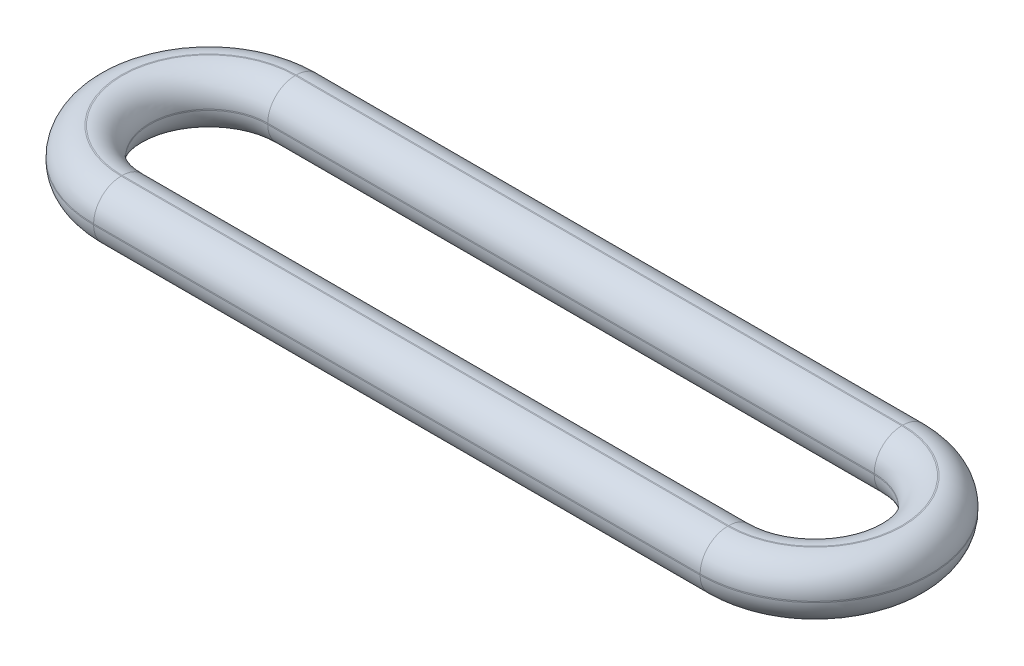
ISO-10303-21;
HEADER;
FILE_DESCRIPTION(('STEP AP214'),'2;1');
FILE_NAME('part.step','',(''),(''),'','','');
FILE_SCHEMA(('AUTOMOTIVE_DESIGN { 1 0 10303 214 1 1 1 1 }'));
ENDSEC;
DATA;
#1=APPLICATION_CONTEXT('core data for automotive mechanical design processes');
#2=APPLICATION_PROTOCOL_DEFINITION('international standard','automotive_design',2000,#1);
#3=PRODUCT_CONTEXT('',#1,'mechanical');
#4=PRODUCT('Part','Part','',(#3));
#5=PRODUCT_RELATED_PRODUCT_CATEGORY('part','',(#4));
#6=PRODUCT_DEFINITION_FORMATION('','',#4);
#7=PRODUCT_DEFINITION_CONTEXT('part definition',#1,'design');
#8=PRODUCT_DEFINITION('design','',#6,#7);
#9=PRODUCT_DEFINITION_SHAPE('','',#8);
#10=(LENGTH_UNIT() NAMED_UNIT(*) SI_UNIT(.MILLI.,.METRE.));
#11=(NAMED_UNIT(*) PLANE_ANGLE_UNIT() SI_UNIT($,.RADIAN.));
#12=(NAMED_UNIT(*) SI_UNIT($,.STERADIAN.) SOLID_ANGLE_UNIT());
#13=UNCERTAINTY_MEASURE_WITH_UNIT(LENGTH_MEASURE(1.E-05),#10,'distance_accuracy_value','');
#14=(GEOMETRIC_REPRESENTATION_CONTEXT(3) GLOBAL_UNCERTAINTY_ASSIGNED_CONTEXT((#13)) GLOBAL_UNIT_ASSIGNED_CONTEXT((#10,
#11,#12)) REPRESENTATION_CONTEXT('',''));
#15=CARTESIAN_POINT('',(0.,0.,0.));
#16=DIRECTION('',(0.,0.,1.));
#17=DIRECTION('',(1.,0.,0.));
#18=AXIS2_PLACEMENT_3D('',#15,#16,#17);
#19=CARTESIAN_POINT('',(0.,1.,0.));
#20=DIRECTION('',(0.,1.,0.));
#21=DIRECTION('',(0.,0.,1.));
#22=AXIS2_PLACEMENT_3D('',#19,#20,#21);
#23=PLANE('',#22);
#24=DIRECTION('',(-1.,0.,0.));
#25=VECTOR('',#24,1.);
#26=CARTESIAN_POINT('',(0.,1.,-1.54));
#27=LINE('',#26,#25);
#28=CARTESIAN_POINT('',(0.,1.,-1.54));
#29=VERTEX_POINT('',#28);
#30=CARTESIAN_POINT('',(10.8,1.,-1.54));
#31=VERTEX_POINT('',#30);
#32=EDGE_CURVE('E52',#29,#31,#27,.F.);
#33=ORIENTED_EDGE('',*,*,#32,.T.);
#34=CARTESIAN_POINT('',(10.8,1.,0.));
#35=DIRECTION('',(0.,1.,0.));
#36=DIRECTION('',(0.,0.,1.));
#37=AXIS2_PLACEMENT_3D('',#34,#35,#36);
#38=CIRCLE('',#37,1.54);
#39=CARTESIAN_POINT('',(10.8,1.,1.54));
#40=VERTEX_POINT('',#39);
#41=EDGE_CURVE('E237',#31,#40,#38,.F.);
#42=ORIENTED_EDGE('',*,*,#41,.T.);
#43=DIRECTION('',(1.,0.,0.));
#44=VECTOR('',#43,1.);
#45=CARTESIAN_POINT('',(0.,1.,1.54));
#46=LINE('',#45,#44);
#47=CARTESIAN_POINT('',(0.,1.,1.54));
#48=VERTEX_POINT('',#47);
#49=EDGE_CURVE('E233',#40,#48,#46,.F.);
#50=ORIENTED_EDGE('',*,*,#49,.T.);
#51=CARTESIAN_POINT('',(0.,1.,0.));
#52=DIRECTION('',(0.,1.,0.));
#53=DIRECTION('',(0.,0.,1.));
#54=AXIS2_PLACEMENT_3D('',#51,#52,#53);
#55=CIRCLE('',#54,1.54);
#56=EDGE_CURVE('E57',#48,#29,#55,.F.);
#57=ORIENTED_EDGE('',*,*,#56,.T.);
#58=EDGE_LOOP('',(#33,#42,#50,#57));
#59=FACE_BOUND('',#58,.T.);
#60=CARTESIAN_POINT('',(10.8,1.,0.));
#61=DIRECTION('',(0.,1.,0.));
#62=DIRECTION('',(0.,0.,1.));
#63=AXIS2_PLACEMENT_3D('',#60,#61,#62);
#64=CIRCLE('',#63,1.56);
#65=CARTESIAN_POINT('',(10.8,1.,1.56));
#66=VERTEX_POINT('',#65);
#67=CARTESIAN_POINT('',(10.8,1.,-1.56));
#68=VERTEX_POINT('',#67);
#69=EDGE_CURVE('E228',#66,#68,#64,.T.);
#70=ORIENTED_EDGE('',*,*,#69,.T.);
#71=DIRECTION('',(-1.,0.,0.));
#72=VECTOR('',#71,1.);
#73=CARTESIAN_POINT('',(0.,1.,-1.56));
#74=LINE('',#73,#72);
#75=CARTESIAN_POINT('',(0.,1.,-1.56));
#76=VERTEX_POINT('',#75);
#77=EDGE_CURVE('E230',#68,#76,#74,.T.);
#78=ORIENTED_EDGE('',*,*,#77,.T.);
#79=CARTESIAN_POINT('',(0.,1.,0.));
#80=DIRECTION('',(0.,1.,0.));
#81=DIRECTION('',(0.,0.,1.));
#82=AXIS2_PLACEMENT_3D('',#79,#80,#81);
#83=CIRCLE('',#82,1.56);
#84=CARTESIAN_POINT('',(0.,1.,1.56));
#85=VERTEX_POINT('',#84);
#86=EDGE_CURVE('E224',#76,#85,#83,.T.);
#87=ORIENTED_EDGE('',*,*,#86,.T.);
#88=DIRECTION('',(1.,0.,0.));
#89=VECTOR('',#88,1.);
#90=CARTESIAN_POINT('',(10.8,1.,1.56));
#91=LINE('',#90,#89);
#92=EDGE_CURVE('E226',#85,#66,#91,.T.);
#93=ORIENTED_EDGE('',*,*,#92,.T.);
#94=EDGE_LOOP('',(#70,#78,#87,#93));
#95=FACE_BOUND('',#94,.T.);
#96=ADVANCED_FACE('F35',(#59,#95),#23,.T.);
#97=CARTESIAN_POINT('',(0.,0.,0.));
#98=DIRECTION('',(0.,1.,0.));
#99=DIRECTION('',(0.,0.,1.));
#100=AXIS2_PLACEMENT_3D('',#97,#98,#99);
#101=PLANE('',#100);
#102=DIRECTION('',(-1.,0.,0.));
#103=VECTOR('',#102,1.);
#104=CARTESIAN_POINT('',(0.,0.,-1.54));
#105=LINE('',#104,#103);
#106=CARTESIAN_POINT('',(10.8,0.,-1.54));
#107=VERTEX_POINT('',#106);
#108=CARTESIAN_POINT('',(0.,0.,-1.54));
#109=VERTEX_POINT('',#108);
#110=EDGE_CURVE('E188',#107,#109,#105,.T.);
#111=ORIENTED_EDGE('',*,*,#110,.T.);
#112=CARTESIAN_POINT('',(0.,0.,0.));
#113=DIRECTION('',(0.,1.,0.));
#114=DIRECTION('',(0.,0.,1.));
#115=AXIS2_PLACEMENT_3D('',#112,#113,#114);
#116=CIRCLE('',#115,1.54);
#117=CARTESIAN_POINT('',(0.,0.,1.54));
#118=VERTEX_POINT('',#117);
#119=EDGE_CURVE('E190',#109,#118,#116,.T.);
#120=ORIENTED_EDGE('',*,*,#119,.T.);
#121=DIRECTION('',(1.,0.,0.));
#122=VECTOR('',#121,1.);
#123=CARTESIAN_POINT('',(10.8,0.,1.54));
#124=LINE('',#123,#122);
#125=CARTESIAN_POINT('',(10.8,0.,1.54));
#126=VERTEX_POINT('',#125);
#127=EDGE_CURVE('E184',#118,#126,#124,.T.);
#128=ORIENTED_EDGE('',*,*,#127,.T.);
#129=CARTESIAN_POINT('',(10.8,0.,0.));
#130=DIRECTION('',(0.,1.,0.));
#131=DIRECTION('',(0.,0.,1.));
#132=AXIS2_PLACEMENT_3D('',#129,#130,#131);
#133=CIRCLE('',#132,1.54);
#134=EDGE_CURVE('E186',#126,#107,#133,.T.);
#135=ORIENTED_EDGE('',*,*,#134,.T.);
#136=EDGE_LOOP('',(#111,#120,#128,#135));
#137=FACE_BOUND('',#136,.T.);
#138=CARTESIAN_POINT('',(10.8,0.,0.));
#139=DIRECTION('',(0.,1.,0.));
#140=DIRECTION('',(0.,0.,1.));
#141=AXIS2_PLACEMENT_3D('',#138,#139,#140);
#142=CIRCLE('',#141,1.56);
#143=CARTESIAN_POINT('',(10.8,0.,-1.56));
#144=VERTEX_POINT('',#143);
#145=CARTESIAN_POINT('',(10.8,0.,1.56));
#146=VERTEX_POINT('',#145);
#147=EDGE_CURVE('E153',#144,#146,#142,.F.);
#148=ORIENTED_EDGE('',*,*,#147,.T.);
#149=DIRECTION('',(1.,0.,0.));
#150=VECTOR('',#149,1.);
#151=CARTESIAN_POINT('',(0.,0.,1.56));
#152=LINE('',#151,#150);
#153=CARTESIAN_POINT('',(0.,0.,1.56));
#154=VERTEX_POINT('',#153);
#155=EDGE_CURVE('E182',#146,#154,#152,.F.);
#156=ORIENTED_EDGE('',*,*,#155,.T.);
#157=CARTESIAN_POINT('',(0.,0.,0.));
#158=DIRECTION('',(0.,1.,0.));
#159=DIRECTION('',(0.,0.,1.));
#160=AXIS2_PLACEMENT_3D('',#157,#158,#159);
#161=CIRCLE('',#160,1.56);
#162=CARTESIAN_POINT('',(0.,0.,-1.56));
#163=VERTEX_POINT('',#162);
#164=EDGE_CURVE('E156',#154,#163,#161,.F.);
#165=ORIENTED_EDGE('',*,*,#164,.T.);
#166=DIRECTION('',(-1.,0.,0.));
#167=VECTOR('',#166,1.);
#168=CARTESIAN_POINT('',(0.,0.,-1.56));
#169=LINE('',#168,#167);
#170=EDGE_CURVE('E148',#163,#144,#169,.F.);
#171=ORIENTED_EDGE('',*,*,#170,.T.);
#172=EDGE_LOOP('',(#148,#156,#165,#171));
#173=FACE_BOUND('',#172,.T.);
#174=ADVANCED_FACE('F150',(#137,#173),#101,.F.);
#175=CARTESIAN_POINT('',(0.,1.,0.));
#176=DIRECTION('',(0.,-1.,0.));
#177=DIRECTION('',(0.,0.,-1.));
#178=AXIS2_PLACEMENT_3D('',#175,#176,#177);
#179=CYLINDRICAL_SURFACE('',#178,2.05);
#180=DIRECTION('',(0.,-1.,0.));
#181=VECTOR('',#180,1.);
#182=CARTESIAN_POINT('',(0.,1.,-2.05));
#183=LINE('',#182,#181);
#184=CARTESIAN_POINT('',(0.,0.51,-2.05));
#185=VERTEX_POINT('',#184);
#186=CARTESIAN_POINT('',(0.,0.49,-2.05));
#187=VERTEX_POINT('',#186);
#188=EDGE_CURVE('E294',#185,#187,#183,.T.);
#189=ORIENTED_EDGE('',*,*,#188,.T.);
#190=CARTESIAN_POINT('',(0.,0.49,0.));
#191=DIRECTION('',(0.,1.,0.));
#192=DIRECTION('',(0.,0.,1.));
#193=AXIS2_PLACEMENT_3D('',#190,#191,#192);
#194=CIRCLE('',#193,2.05);
#195=CARTESIAN_POINT('',(0.,0.49,2.05));
#196=VERTEX_POINT('',#195);
#197=EDGE_CURVE('E214',#187,#196,#194,.T.);
#198=ORIENTED_EDGE('',*,*,#197,.T.);
#199=DIRECTION('',(0.,-1.,0.));
#200=VECTOR('',#199,1.);
#201=CARTESIAN_POINT('',(0.,1.,2.05));
#202=LINE('',#201,#200);
#203=CARTESIAN_POINT('',(0.,0.51,2.05));
#204=VERTEX_POINT('',#203);
#205=EDGE_CURVE('E174',#204,#196,#202,.T.);
#206=ORIENTED_EDGE('',*,*,#205,.F.);
#207=CARTESIAN_POINT('',(0.,0.51,0.));
#208=DIRECTION('',(0.,1.,0.));
#209=DIRECTION('',(0.,0.,1.));
#210=AXIS2_PLACEMENT_3D('',#207,#208,#209);
#211=CIRCLE('',#210,2.05);
#212=EDGE_CURVE('E212',#204,#185,#211,.F.);
#213=ORIENTED_EDGE('',*,*,#212,.T.);
#214=EDGE_LOOP('',(#189,#198,#206,#213));
#215=FACE_BOUND('',#214,.T.);
#216=ADVANCED_FACE('F291',(#215),#179,.T.);
#217=CARTESIAN_POINT('',(10.8,1.,2.05));
#218=DIRECTION('',(0.,0.,-1.));
#219=DIRECTION('',(-1.,0.,0.));
#220=AXIS2_PLACEMENT_3D('',#217,#218,#219);
#221=PLANE('',#220);
#222=ORIENTED_EDGE('',*,*,#205,.T.);
#223=DIRECTION('',(1.,0.,0.));
#224=VECTOR('',#223,1.);
#225=CARTESIAN_POINT('',(10.8,0.49,2.05));
#226=LINE('',#225,#224);
#227=CARTESIAN_POINT('',(10.8,0.49,2.05));
#228=VERTEX_POINT('',#227);
#229=EDGE_CURVE('E209',#196,#228,#226,.T.);
#230=ORIENTED_EDGE('',*,*,#229,.T.);
#231=DIRECTION('',(0.,-1.,0.));
#232=VECTOR('',#231,1.);
#233=CARTESIAN_POINT('',(10.8,1.,2.05));
#234=LINE('',#233,#232);
#235=CARTESIAN_POINT('',(10.8,0.51,2.05));
#236=VERTEX_POINT('',#235);
#237=EDGE_CURVE('E177',#236,#228,#234,.T.);
#238=ORIENTED_EDGE('',*,*,#237,.F.);
#239=DIRECTION('',(1.,0.,0.));
#240=VECTOR('',#239,1.);
#241=CARTESIAN_POINT('',(0.,0.51,2.05));
#242=LINE('',#241,#240);
#243=EDGE_CURVE('E207',#236,#204,#242,.F.);
#244=ORIENTED_EDGE('',*,*,#243,.T.);
#245=EDGE_LOOP('',(#222,#230,#238,#244));
#246=FACE_BOUND('',#245,.T.);
#247=ADVANCED_FACE('F286',(#246),#221,.F.);
#248=CARTESIAN_POINT('',(10.8,1.,0.));
#249=DIRECTION('',(0.,-1.,0.));
#250=DIRECTION('',(0.,0.,-1.));
#251=AXIS2_PLACEMENT_3D('',#248,#249,#250);
#252=CYLINDRICAL_SURFACE('',#251,2.05);
#253=DIRECTION('',(0.,-1.,0.));
#254=VECTOR('',#253,1.);
#255=CARTESIAN_POINT('',(10.8,1.,-2.05));
#256=LINE('',#255,#254);
#257=CARTESIAN_POINT('',(10.8,0.51,-2.05));
#258=VERTEX_POINT('',#257);
#259=CARTESIAN_POINT('',(10.8,0.49,-2.05));
#260=VERTEX_POINT('',#259);
#261=EDGE_CURVE('E304',#258,#260,#256,.T.);
#262=ORIENTED_EDGE('',*,*,#261,.F.);
#263=CARTESIAN_POINT('',(10.8,0.51,0.));
#264=DIRECTION('',(0.,1.,0.));
#265=DIRECTION('',(0.,0.,1.));
#266=AXIS2_PLACEMENT_3D('',#263,#264,#265);
#267=CIRCLE('',#266,2.05);
#268=EDGE_CURVE('E11',#258,#236,#267,.F.);
#269=ORIENTED_EDGE('',*,*,#268,.T.);
#270=ORIENTED_EDGE('',*,*,#237,.T.);
#271=CARTESIAN_POINT('',(10.8,0.49,0.));
#272=DIRECTION('',(0.,1.,0.));
#273=DIRECTION('',(0.,0.,1.));
#274=AXIS2_PLACEMENT_3D('',#271,#272,#273);
#275=CIRCLE('',#274,2.05);
#276=EDGE_CURVE('E44',#228,#260,#275,.T.);
#277=ORIENTED_EDGE('',*,*,#276,.T.);
#278=EDGE_LOOP('',(#262,#269,#270,#277));
#279=FACE_BOUND('',#278,.T.);
#280=ADVANCED_FACE('F302',(#279),#252,.T.);
#281=CARTESIAN_POINT('',(0.,1.,-2.05));
#282=DIRECTION('',(0.,0.,1.));
#283=DIRECTION('',(1.,0.,0.));
#284=AXIS2_PLACEMENT_3D('',#281,#282,#283);
#285=PLANE('',#284);
#286=ORIENTED_EDGE('',*,*,#261,.T.);
#287=DIRECTION('',(-1.,0.,0.));
#288=VECTOR('',#287,1.);
#289=CARTESIAN_POINT('',(0.,0.49,-2.05));
#290=LINE('',#289,#288);
#291=EDGE_CURVE('E165',#260,#187,#290,.T.);
#292=ORIENTED_EDGE('',*,*,#291,.T.);
#293=ORIENTED_EDGE('',*,*,#188,.F.);
#294=DIRECTION('',(-1.,0.,0.));
#295=VECTOR('',#294,1.);
#296=CARTESIAN_POINT('',(10.8,0.51,-2.05));
#297=LINE('',#296,#295);
#298=EDGE_CURVE('E216',#185,#258,#297,.F.);
#299=ORIENTED_EDGE('',*,*,#298,.T.);
#300=EDGE_LOOP('',(#286,#292,#293,#299));
#301=FACE_BOUND('',#300,.T.);
#302=ADVANCED_FACE('F386',(#301),#285,.F.);
#303=CARTESIAN_POINT('',(0.,1.,0.));
#304=DIRECTION('',(0.,-1.,0.));
#305=DIRECTION('',(0.,0.,-1.));
#306=AXIS2_PLACEMENT_3D('',#303,#304,#305);
#307=CYLINDRICAL_SURFACE('',#306,1.05);
#308=DIRECTION('',(0.,-1.,0.));
#309=VECTOR('',#308,1.);
#310=CARTESIAN_POINT('',(0.,1.,1.05));
#311=LINE('',#310,#309);
#312=CARTESIAN_POINT('',(0.,0.51,1.05));
#313=VERTEX_POINT('',#312);
#314=CARTESIAN_POINT('',(0.,0.49,1.05));
#315=VERTEX_POINT('',#314);
#316=EDGE_CURVE('E308',#313,#315,#311,.T.);
#317=ORIENTED_EDGE('',*,*,#316,.T.);
#318=CARTESIAN_POINT('',(0.,0.49,0.));
#319=DIRECTION('',(0.,1.,0.));
#320=DIRECTION('',(0.,0.,1.));
#321=AXIS2_PLACEMENT_3D('',#318,#319,#320);
#322=CIRCLE('',#321,1.05);
#323=CARTESIAN_POINT('',(0.,0.49,-1.05));
#324=VERTEX_POINT('',#323);
#325=EDGE_CURVE('E195',#315,#324,#322,.F.);
#326=ORIENTED_EDGE('',*,*,#325,.T.);
#327=DIRECTION('',(0.,-1.,0.));
#328=VECTOR('',#327,1.);
#329=CARTESIAN_POINT('',(0.,1.,-1.05));
#330=LINE('',#329,#328);
#331=CARTESIAN_POINT('',(0.,0.51,-1.05));
#332=VERTEX_POINT('',#331);
#333=EDGE_CURVE('E250',#332,#324,#330,.T.);
#334=ORIENTED_EDGE('',*,*,#333,.F.);
#335=CARTESIAN_POINT('',(0.,0.51,0.));
#336=DIRECTION('',(0.,1.,0.));
#337=DIRECTION('',(0.,0.,1.));
#338=AXIS2_PLACEMENT_3D('',#335,#336,#337);
#339=CIRCLE('',#338,1.05);
#340=EDGE_CURVE('E193',#332,#313,#339,.T.);
#341=ORIENTED_EDGE('',*,*,#340,.T.);
#342=EDGE_LOOP('',(#317,#326,#334,#341));
#343=FACE_BOUND('',#342,.T.);
#344=ADVANCED_FACE('F326',(#343),#307,.F.);
#345=CARTESIAN_POINT('',(10.8,1.,1.05));
#346=DIRECTION('',(0.,0.,-1.));
#347=DIRECTION('',(-1.,0.,0.));
#348=AXIS2_PLACEMENT_3D('',#345,#346,#347);
#349=PLANE('',#348);
#350=DIRECTION('',(0.,-1.,0.));
#351=VECTOR('',#350,1.);
#352=CARTESIAN_POINT('',(10.8,1.,1.05));
#353=LINE('',#352,#351);
#354=CARTESIAN_POINT('',(10.8,0.51,1.05));
#355=VERTEX_POINT('',#354);
#356=CARTESIAN_POINT('',(10.8,0.49,1.05));
#357=VERTEX_POINT('',#356);
#358=EDGE_CURVE('E311',#355,#357,#353,.T.);
#359=ORIENTED_EDGE('',*,*,#358,.T.);
#360=DIRECTION('',(1.,0.,0.));
#361=VECTOR('',#360,1.);
#362=CARTESIAN_POINT('',(0.,0.49,1.05));
#363=LINE('',#362,#361);
#364=EDGE_CURVE('E222',#357,#315,#363,.F.);
#365=ORIENTED_EDGE('',*,*,#364,.T.);
#366=ORIENTED_EDGE('',*,*,#316,.F.);
#367=DIRECTION('',(1.,0.,0.));
#368=VECTOR('',#367,1.);
#369=CARTESIAN_POINT('',(10.8,0.51,1.05));
#370=LINE('',#369,#368);
#371=EDGE_CURVE('E220',#313,#355,#370,.T.);
#372=ORIENTED_EDGE('',*,*,#371,.T.);
#373=EDGE_LOOP('',(#359,#365,#366,#372));
#374=FACE_BOUND('',#373,.T.);
#375=ADVANCED_FACE('F346',(#374),#349,.T.);
#376=CARTESIAN_POINT('',(10.8,1.,0.));
#377=DIRECTION('',(0.,-1.,0.));
#378=DIRECTION('',(0.,0.,-1.));
#379=AXIS2_PLACEMENT_3D('',#376,#377,#378);
#380=CYLINDRICAL_SURFACE('',#379,1.05);
#381=DIRECTION('',(0.,-1.,0.));
#382=VECTOR('',#381,1.);
#383=CARTESIAN_POINT('',(10.8,1.,-1.05));
#384=LINE('',#383,#382);
#385=CARTESIAN_POINT('',(10.8,0.51,-1.05));
#386=VERTEX_POINT('',#385);
#387=CARTESIAN_POINT('',(10.8,0.49,-1.05));
#388=VERTEX_POINT('',#387);
#389=EDGE_CURVE('E314',#386,#388,#384,.T.);
#390=ORIENTED_EDGE('',*,*,#389,.T.);
#391=CARTESIAN_POINT('',(10.8,0.49,0.));
#392=DIRECTION('',(0.,1.,0.));
#393=DIRECTION('',(0.,0.,1.));
#394=AXIS2_PLACEMENT_3D('',#391,#392,#393);
#395=CIRCLE('',#394,1.05);
#396=EDGE_CURVE('E205',#388,#357,#395,.F.);
#397=ORIENTED_EDGE('',*,*,#396,.T.);
#398=ORIENTED_EDGE('',*,*,#358,.F.);
#399=CARTESIAN_POINT('',(10.8,0.51,0.));
#400=DIRECTION('',(0.,1.,0.));
#401=DIRECTION('',(0.,0.,1.));
#402=AXIS2_PLACEMENT_3D('',#399,#400,#401);
#403=CIRCLE('',#402,1.05);
#404=EDGE_CURVE('E202',#355,#386,#403,.T.);
#405=ORIENTED_EDGE('',*,*,#404,.T.);
#406=EDGE_LOOP('',(#390,#397,#398,#405));
#407=FACE_BOUND('',#406,.T.);
#408=ADVANCED_FACE('F349',(#407),#380,.F.);
#409=CARTESIAN_POINT('',(0.,1.,-1.05));
#410=DIRECTION('',(0.,0.,1.));
#411=DIRECTION('',(1.,0.,0.));
#412=AXIS2_PLACEMENT_3D('',#409,#410,#411);
#413=PLANE('',#412);
#414=ORIENTED_EDGE('',*,*,#333,.T.);
#415=DIRECTION('',(-1.,0.,0.));
#416=VECTOR('',#415,1.);
#417=CARTESIAN_POINT('',(10.8,0.49,-1.05));
#418=LINE('',#417,#416);
#419=EDGE_CURVE('E200',#324,#388,#418,.F.);
#420=ORIENTED_EDGE('',*,*,#419,.T.);
#421=ORIENTED_EDGE('',*,*,#389,.F.);
#422=DIRECTION('',(-1.,0.,0.));
#423=VECTOR('',#422,1.);
#424=CARTESIAN_POINT('',(0.,0.51,-1.05));
#425=LINE('',#424,#423);
#426=EDGE_CURVE('E198',#386,#332,#425,.T.);
#427=ORIENTED_EDGE('',*,*,#426,.T.);
#428=EDGE_LOOP('',(#414,#420,#421,#427));
#429=FACE_BOUND('',#428,.T.);
#430=ADVANCED_FACE('F320',(#429),#413,.T.);
#431=CARTESIAN_POINT('',(10.8,0.49,0.));
#432=DIRECTION('',(0.,1.,0.));
#433=DIRECTION('',(0.,0.,1.));
#434=AXIS2_PLACEMENT_3D('',#431,#432,#433);
#435=TOROIDAL_SURFACE('',#434,1.54,0.49);
#436=CARTESIAN_POINT('',(10.8,0.49,1.54));
#437=DIRECTION('',(-1.,0.,0.));
#438=DIRECTION('',(0.,0.,1.));
#439=AXIS2_PLACEMENT_3D('',#436,#437,#438);
#440=CIRCLE('',#439,0.49);
#441=EDGE_CURVE('E244',#357,#126,#440,.T.);
#442=ORIENTED_EDGE('',*,*,#441,.F.);
#443=ORIENTED_EDGE('',*,*,#396,.F.);
#444=CARTESIAN_POINT('',(10.8,0.49,-1.54));
#445=DIRECTION('',(-1.,0.,0.));
#446=DIRECTION('',(0.,0.,1.));
#447=AXIS2_PLACEMENT_3D('',#444,#445,#446);
#448=CIRCLE('',#447,0.49);
#449=EDGE_CURVE('E247',#107,#388,#448,.T.);
#450=ORIENTED_EDGE('',*,*,#449,.F.);
#451=ORIENTED_EDGE('',*,*,#134,.F.);
#452=EDGE_LOOP('',(#442,#443,#450,#451));
#453=FACE_BOUND('',#452,.T.);
#454=ADVANCED_FACE('F353',(#453),#435,.T.);
#455=CARTESIAN_POINT('',(0.,0.49,-1.54));
#456=DIRECTION('',(1.,0.,0.));
#457=DIRECTION('',(0.,0.,-1.));
#458=AXIS2_PLACEMENT_3D('',#455,#456,#457);
#459=CYLINDRICAL_SURFACE('',#458,0.49);
#460=ORIENTED_EDGE('',*,*,#449,.T.);
#461=ORIENTED_EDGE('',*,*,#419,.F.);
#462=CARTESIAN_POINT('',(0.,0.49,-1.54));
#463=DIRECTION('',(-1.,0.,0.));
#464=DIRECTION('',(0.,0.,1.));
#465=AXIS2_PLACEMENT_3D('',#462,#463,#464);
#466=CIRCLE('',#465,0.49);
#467=EDGE_CURVE('E242',#109,#324,#466,.T.);
#468=ORIENTED_EDGE('',*,*,#467,.F.);
#469=ORIENTED_EDGE('',*,*,#110,.F.);
#470=EDGE_LOOP('',(#460,#461,#468,#469));
#471=FACE_BOUND('',#470,.T.);
#472=ADVANCED_FACE('F358',(#471),#459,.T.);
#473=CARTESIAN_POINT('',(0.,0.49,1.54));
#474=DIRECTION('',(-1.,0.,0.));
#475=DIRECTION('',(0.,0.,1.));
#476=AXIS2_PLACEMENT_3D('',#473,#474,#475);
#477=CYLINDRICAL_SURFACE('',#476,0.49);
#478=ORIENTED_EDGE('',*,*,#441,.T.);
#479=ORIENTED_EDGE('',*,*,#127,.F.);
#480=CARTESIAN_POINT('',(0.,0.49,1.54));
#481=DIRECTION('',(-1.,0.,0.));
#482=DIRECTION('',(0.,0.,1.));
#483=AXIS2_PLACEMENT_3D('',#480,#481,#482);
#484=CIRCLE('',#483,0.49);
#485=EDGE_CURVE('E240',#315,#118,#484,.T.);
#486=ORIENTED_EDGE('',*,*,#485,.F.);
#487=ORIENTED_EDGE('',*,*,#364,.F.);
#488=EDGE_LOOP('',(#478,#479,#486,#487));
#489=FACE_BOUND('',#488,.T.);
#490=ADVANCED_FACE('F364',(#489),#477,.T.);
#491=CARTESIAN_POINT('',(0.,0.49,0.));
#492=DIRECTION('',(0.,1.,0.));
#493=DIRECTION('',(0.,0.,1.));
#494=AXIS2_PLACEMENT_3D('',#491,#492,#493);
#495=TOROIDAL_SURFACE('',#494,1.54,0.49);
#496=ORIENTED_EDGE('',*,*,#467,.T.);
#497=ORIENTED_EDGE('',*,*,#325,.F.);
#498=ORIENTED_EDGE('',*,*,#485,.T.);
#499=ORIENTED_EDGE('',*,*,#119,.F.);
#500=EDGE_LOOP('',(#496,#497,#498,#499));
#501=FACE_BOUND('',#500,.T.);
#502=ADVANCED_FACE('F367',(#501),#495,.T.);
#503=CARTESIAN_POINT('',(0.,0.49,-1.56));
#504=DIRECTION('',(-1.,0.,0.));
#505=DIRECTION('',(0.,0.,1.));
#506=AXIS2_PLACEMENT_3D('',#503,#504,#505);
#507=CYLINDRICAL_SURFACE('',#506,0.49);
#508=CARTESIAN_POINT('',(10.8,0.49,-1.56));
#509=DIRECTION('',(1.,0.,0.));
#510=DIRECTION('',(0.,0.,-1.));
#511=AXIS2_PLACEMENT_3D('',#508,#509,#510);
#512=CIRCLE('',#511,0.49);
#513=EDGE_CURVE('E163',#144,#260,#512,.T.);
#514=ORIENTED_EDGE('',*,*,#513,.F.);
#515=ORIENTED_EDGE('',*,*,#170,.F.);
#516=CARTESIAN_POINT('',(0.,0.49,-1.56));
#517=DIRECTION('',(-1.,0.,0.));
#518=DIRECTION('',(0.,0.,1.));
#519=AXIS2_PLACEMENT_3D('',#516,#517,#518);
#520=CIRCLE('',#519,0.49);
#521=EDGE_CURVE('E168',#187,#163,#520,.T.);
#522=ORIENTED_EDGE('',*,*,#521,.F.);
#523=ORIENTED_EDGE('',*,*,#291,.F.);
#524=EDGE_LOOP('',(#514,#515,#522,#523));
#525=FACE_BOUND('',#524,.T.);
#526=ADVANCED_FACE('F164',(#525),#507,.T.);
#527=CARTESIAN_POINT('',(0.,0.49,0.));
#528=DIRECTION('',(0.,1.,0.));
#529=DIRECTION('',(0.,0.,1.));
#530=AXIS2_PLACEMENT_3D('',#527,#528,#529);
#531=TOROIDAL_SURFACE('',#530,1.56,0.49);
#532=ORIENTED_EDGE('',*,*,#521,.T.);
#533=ORIENTED_EDGE('',*,*,#164,.F.);
#534=CARTESIAN_POINT('',(0.,0.49,1.56));
#535=DIRECTION('',(1.,0.,0.));
#536=DIRECTION('',(0.,1.,0.));
#537=AXIS2_PLACEMENT_3D('',#534,#535,#536);
#538=CIRCLE('',#537,0.49);
#539=EDGE_CURVE('E169',#196,#154,#538,.T.);
#540=ORIENTED_EDGE('',*,*,#539,.F.);
#541=ORIENTED_EDGE('',*,*,#197,.F.);
#542=EDGE_LOOP('',(#532,#533,#540,#541));
#543=FACE_BOUND('',#542,.T.);
#544=ADVANCED_FACE('F296',(#543),#531,.T.);
#545=CARTESIAN_POINT('',(10.8,0.49,0.));
#546=DIRECTION('',(0.,1.,0.));
#547=DIRECTION('',(0.,0.,1.));
#548=AXIS2_PLACEMENT_3D('',#545,#546,#547);
#549=TOROIDAL_SURFACE('',#548,1.56,0.49);
#550=ORIENTED_EDGE('',*,*,#513,.T.);
#551=ORIENTED_EDGE('',*,*,#276,.F.);
#552=CARTESIAN_POINT('',(10.8,0.49,1.56));
#553=DIRECTION('',(-1.,0.,0.));
#554=DIRECTION('',(0.,0.,1.));
#555=AXIS2_PLACEMENT_3D('',#552,#553,#554);
#556=CIRCLE('',#555,0.49);
#557=EDGE_CURVE('E173',#146,#228,#556,.T.);
#558=ORIENTED_EDGE('',*,*,#557,.F.);
#559=ORIENTED_EDGE('',*,*,#147,.F.);
#560=EDGE_LOOP('',(#550,#551,#558,#559));
#561=FACE_BOUND('',#560,.T.);
#562=ADVANCED_FACE('F172',(#561),#549,.T.);
#563=CARTESIAN_POINT('',(10.8,0.49,1.56));
#564=DIRECTION('',(1.,0.,0.));
#565=DIRECTION('',(0.,0.,-1.));
#566=AXIS2_PLACEMENT_3D('',#563,#564,#565);
#567=CYLINDRICAL_SURFACE('',#566,0.49);
#568=ORIENTED_EDGE('',*,*,#539,.T.);
#569=ORIENTED_EDGE('',*,*,#155,.F.);
#570=ORIENTED_EDGE('',*,*,#557,.T.);
#571=ORIENTED_EDGE('',*,*,#229,.F.);
#572=EDGE_LOOP('',(#568,#569,#570,#571));
#573=FACE_BOUND('',#572,.T.);
#574=ADVANCED_FACE('F299',(#573),#567,.T.);
#575=CARTESIAN_POINT('',(0.,0.51,0.));
#576=DIRECTION('',(0.,1.,0.));
#577=DIRECTION('',(0.,0.,1.));
#578=AXIS2_PLACEMENT_3D('',#575,#576,#577);
#579=TOROIDAL_SURFACE('',#578,1.54,0.49);
#580=CARTESIAN_POINT('',(0.,0.51,-1.54));
#581=DIRECTION('',(1.,0.,0.));
#582=DIRECTION('',(0.,0.,-1.));
#583=AXIS2_PLACEMENT_3D('',#580,#581,#582);
#584=CIRCLE('',#583,0.49);
#585=EDGE_CURVE('E259',#29,#332,#584,.T.);
#586=ORIENTED_EDGE('',*,*,#585,.F.);
#587=ORIENTED_EDGE('',*,*,#56,.F.);
#588=CARTESIAN_POINT('',(0.,0.51,1.54));
#589=DIRECTION('',(1.,0.,0.));
#590=DIRECTION('',(0.,0.,-1.));
#591=AXIS2_PLACEMENT_3D('',#588,#589,#590);
#592=CIRCLE('',#591,0.49);
#593=EDGE_CURVE('E252',#313,#48,#592,.T.);
#594=ORIENTED_EDGE('',*,*,#593,.F.);
#595=ORIENTED_EDGE('',*,*,#340,.F.);
#596=EDGE_LOOP('',(#586,#587,#594,#595));
#597=FACE_BOUND('',#596,.T.);
#598=ADVANCED_FACE('F331',(#597),#579,.T.);
#599=CARTESIAN_POINT('',(10.8,0.51,1.54));
#600=DIRECTION('',(1.,0.,0.));
#601=DIRECTION('',(0.,0.,-1.));
#602=AXIS2_PLACEMENT_3D('',#599,#600,#601);
#603=CYLINDRICAL_SURFACE('',#602,0.49);
#604=ORIENTED_EDGE('',*,*,#593,.T.);
#605=ORIENTED_EDGE('',*,*,#49,.F.);
#606=CARTESIAN_POINT('',(10.8,0.51,1.54));
#607=DIRECTION('',(1.,0.,0.));
#608=DIRECTION('',(0.,0.,-1.));
#609=AXIS2_PLACEMENT_3D('',#606,#607,#608);
#610=CIRCLE('',#609,0.49);
#611=EDGE_CURVE('E257',#355,#40,#610,.T.);
#612=ORIENTED_EDGE('',*,*,#611,.F.);
#613=ORIENTED_EDGE('',*,*,#371,.F.);
#614=EDGE_LOOP('',(#604,#605,#612,#613));
#615=FACE_BOUND('',#614,.T.);
#616=ADVANCED_FACE('F343',(#615),#603,.T.);
#617=CARTESIAN_POINT('',(0.,0.51,-1.54));
#618=DIRECTION('',(-1.,0.,0.));
#619=DIRECTION('',(0.,0.,1.));
#620=AXIS2_PLACEMENT_3D('',#617,#618,#619);
#621=CYLINDRICAL_SURFACE('',#620,0.49);
#622=ORIENTED_EDGE('',*,*,#585,.T.);
#623=ORIENTED_EDGE('',*,*,#426,.F.);
#624=CARTESIAN_POINT('',(10.8,0.51,-1.54));
#625=DIRECTION('',(1.,0.,0.));
#626=DIRECTION('',(0.,0.,-1.));
#627=AXIS2_PLACEMENT_3D('',#624,#625,#626);
#628=CIRCLE('',#627,0.49);
#629=EDGE_CURVE('E255',#31,#386,#628,.T.);
#630=ORIENTED_EDGE('',*,*,#629,.F.);
#631=ORIENTED_EDGE('',*,*,#32,.F.);
#632=EDGE_LOOP('',(#622,#623,#630,#631));
#633=FACE_BOUND('',#632,.T.);
#634=ADVANCED_FACE('F334',(#633),#621,.T.);
#635=CARTESIAN_POINT('',(10.8,0.51,0.));
#636=DIRECTION('',(0.,1.,0.));
#637=DIRECTION('',(0.,0.,1.));
#638=AXIS2_PLACEMENT_3D('',#635,#636,#637);
#639=TOROIDAL_SURFACE('',#638,1.54,0.49);
#640=ORIENTED_EDGE('',*,*,#611,.T.);
#641=ORIENTED_EDGE('',*,*,#41,.F.);
#642=ORIENTED_EDGE('',*,*,#629,.T.);
#643=ORIENTED_EDGE('',*,*,#404,.F.);
#644=EDGE_LOOP('',(#640,#641,#642,#643));
#645=FACE_BOUND('',#644,.T.);
#646=ADVANCED_FACE('F338',(#645),#639,.T.);
#647=CARTESIAN_POINT('',(0.,0.51,1.56));
#648=DIRECTION('',(-1.,0.,0.));
#649=DIRECTION('',(0.,0.,1.));
#650=AXIS2_PLACEMENT_3D('',#647,#648,#649);
#651=CYLINDRICAL_SURFACE('',#650,0.49);
#652=CARTESIAN_POINT('',(0.,0.51,1.56));
#653=DIRECTION('',(-1.,0.,0.));
#654=DIRECTION('',(0.,0.,1.));
#655=AXIS2_PLACEMENT_3D('',#652,#653,#654);
#656=CIRCLE('',#655,0.49);
#657=EDGE_CURVE('E267',#204,#85,#656,.T.);
#658=ORIENTED_EDGE('',*,*,#657,.F.);
#659=ORIENTED_EDGE('',*,*,#243,.F.);
#660=CARTESIAN_POINT('',(10.8,0.51,1.56));
#661=DIRECTION('',(1.,0.,0.));
#662=DIRECTION('',(0.,0.,-1.));
#663=AXIS2_PLACEMENT_3D('',#660,#661,#662);
#664=CIRCLE('',#663,0.49);
#665=EDGE_CURVE('E39',#66,#236,#664,.T.);
#666=ORIENTED_EDGE('',*,*,#665,.F.);
#667=ORIENTED_EDGE('',*,*,#92,.F.);
#668=EDGE_LOOP('',(#658,#659,#666,#667));
#669=FACE_BOUND('',#668,.T.);
#670=ADVANCED_FACE('F37',(#669),#651,.T.);
#671=CARTESIAN_POINT('',(10.8,0.51,0.));
#672=DIRECTION('',(0.,1.,0.));
#673=DIRECTION('',(0.,0.,1.));
#674=AXIS2_PLACEMENT_3D('',#671,#672,#673);
#675=TOROIDAL_SURFACE('',#674,1.56,0.49);
#676=ORIENTED_EDGE('',*,*,#665,.T.);
#677=ORIENTED_EDGE('',*,*,#268,.F.);
#678=CARTESIAN_POINT('',(10.8,0.51,-1.56));
#679=DIRECTION('',(-1.,0.,0.));
#680=DIRECTION('',(0.,0.,1.));
#681=AXIS2_PLACEMENT_3D('',#678,#679,#680);
#682=CIRCLE('',#681,0.49);
#683=EDGE_CURVE('E266',#68,#258,#682,.T.);
#684=ORIENTED_EDGE('',*,*,#683,.F.);
#685=ORIENTED_EDGE('',*,*,#69,.F.);
#686=EDGE_LOOP('',(#676,#677,#684,#685));
#687=FACE_BOUND('',#686,.T.);
#688=ADVANCED_FACE('F278',(#687),#675,.T.);
#689=CARTESIAN_POINT('',(0.,0.51,0.));
#690=DIRECTION('',(0.,1.,0.));
#691=DIRECTION('',(0.,0.,1.));
#692=AXIS2_PLACEMENT_3D('',#689,#690,#691);
#693=TOROIDAL_SURFACE('',#692,1.56,0.49);
#694=ORIENTED_EDGE('',*,*,#657,.T.);
#695=ORIENTED_EDGE('',*,*,#86,.F.);
#696=CARTESIAN_POINT('',(0.,0.51,-1.56));
#697=DIRECTION('',(1.,0.,0.));
#698=DIRECTION('',(0.,0.,-1.));
#699=AXIS2_PLACEMENT_3D('',#696,#697,#698);
#700=CIRCLE('',#699,0.49);
#701=EDGE_CURVE('E264',#185,#76,#700,.T.);
#702=ORIENTED_EDGE('',*,*,#701,.F.);
#703=ORIENTED_EDGE('',*,*,#212,.F.);
#704=EDGE_LOOP('',(#694,#695,#702,#703));
#705=FACE_BOUND('',#704,.T.);
#706=ADVANCED_FACE('F530',(#705),#693,.T.);
#707=CARTESIAN_POINT('',(0.,0.51,-1.56));
#708=DIRECTION('',(1.,0.,0.));
#709=DIRECTION('',(0.,0.,-1.));
#710=AXIS2_PLACEMENT_3D('',#707,#708,#709);
#711=CYLINDRICAL_SURFACE('',#710,0.49);
#712=ORIENTED_EDGE('',*,*,#683,.T.);
#713=ORIENTED_EDGE('',*,*,#298,.F.);
#714=ORIENTED_EDGE('',*,*,#701,.T.);
#715=ORIENTED_EDGE('',*,*,#77,.F.);
#716=EDGE_LOOP('',(#712,#713,#714,#715));
#717=FACE_BOUND('',#716,.T.);
#718=ADVANCED_FACE('F538',(#717),#711,.T.);
#719=CLOSED_SHELL('',(#96,#174,#216,#247,#280,#302,#344,#375,#408,#430,#454,#472,#490,#502,#526,
#544,#562,#574,#598,#616,#634,#646,#670,#688,#706,#718));
#720=MANIFOLD_SOLID_BREP('B2',#719);
#721=ADVANCED_BREP_SHAPE_REPRESENTATION('',(#18,#720),#14);
#722=SHAPE_DEFINITION_REPRESENTATION(#9,#721);
ENDSEC;
END-ISO-10303-21;
